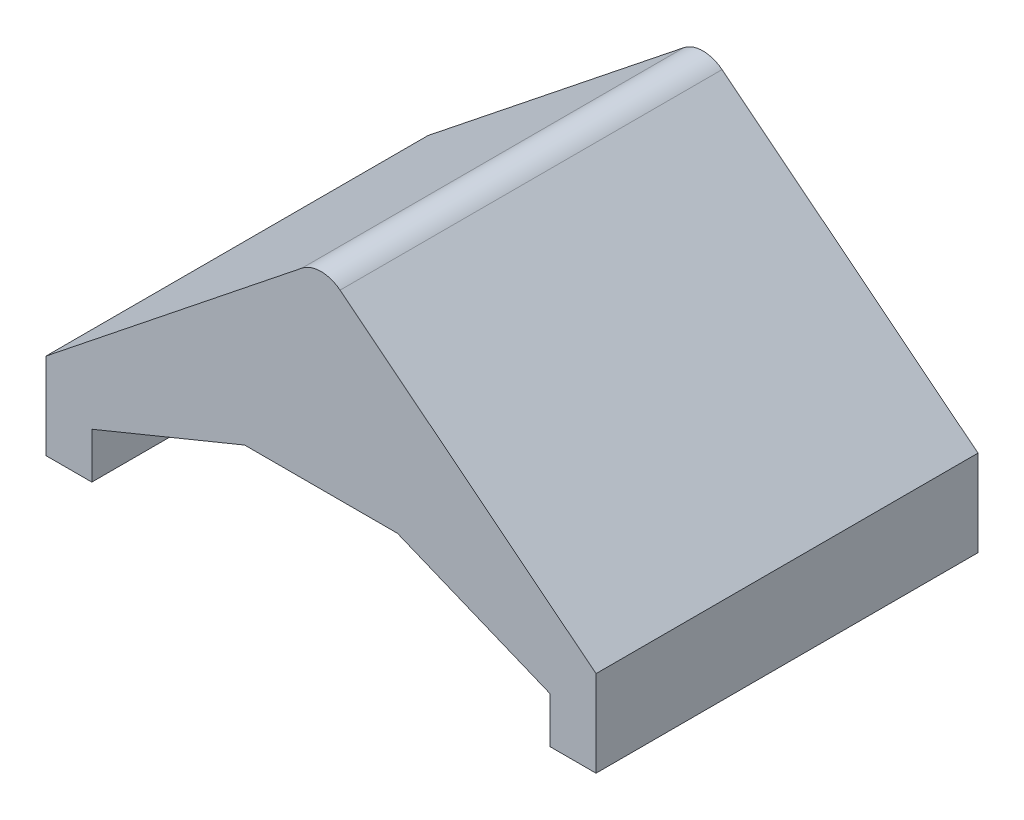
ISO-10303-21;
HEADER;
FILE_DESCRIPTION(('STEP AP214'),'2;1');
FILE_NAME('part.step','',(''),(''),'','','');
FILE_SCHEMA(('AUTOMOTIVE_DESIGN { 1 0 10303 214 1 1 1 1 }'));
ENDSEC;
DATA;
#1=APPLICATION_CONTEXT('core data for automotive mechanical design processes');
#2=APPLICATION_PROTOCOL_DEFINITION('international standard','automotive_design',2000,#1);
#3=PRODUCT_CONTEXT('',#1,'mechanical');
#4=PRODUCT('Part','Part','',(#3));
#5=PRODUCT_RELATED_PRODUCT_CATEGORY('part','',(#4));
#6=PRODUCT_DEFINITION_FORMATION('','',#4);
#7=PRODUCT_DEFINITION_CONTEXT('part definition',#1,'design');
#8=PRODUCT_DEFINITION('design','',#6,#7);
#9=PRODUCT_DEFINITION_SHAPE('','',#8);
#10=(LENGTH_UNIT() NAMED_UNIT(*) SI_UNIT(.MILLI.,.METRE.));
#11=(NAMED_UNIT(*) PLANE_ANGLE_UNIT() SI_UNIT($,.RADIAN.));
#12=(NAMED_UNIT(*) SI_UNIT($,.STERADIAN.) SOLID_ANGLE_UNIT());
#13=UNCERTAINTY_MEASURE_WITH_UNIT(LENGTH_MEASURE(1.E-05),#10,'distance_accuracy_value','');
#14=(GEOMETRIC_REPRESENTATION_CONTEXT(3) GLOBAL_UNCERTAINTY_ASSIGNED_CONTEXT((#13)) GLOBAL_UNIT_ASSIGNED_CONTEXT((#10,
#11,#12)) REPRESENTATION_CONTEXT('',''));
#15=CARTESIAN_POINT('',(0.,0.,0.));
#16=DIRECTION('',(0.,0.,1.));
#17=DIRECTION('',(1.,0.,0.));
#18=AXIS2_PLACEMENT_3D('',#15,#16,#17);
#19=CARTESIAN_POINT('',(0.,5.6457513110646,25.));
#20=DIRECTION('',(1.,0.,0.));
#21=DIRECTION('',(0.,1.,0.));
#22=AXIS2_PLACEMENT_3D('',#19,#20,#21);
#23=PLANE('',#22);
#24=DIRECTION('',(0.,-1.,0.));
#25=VECTOR('',#24,1.);
#26=CARTESIAN_POINT('',(0.,5.6457513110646,0.));
#27=LINE('',#26,#25);
#28=CARTESIAN_POINT('',(0.,5.6457513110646,0.));
#29=VERTEX_POINT('',#28);
#30=CARTESIAN_POINT('',(0.,0.,0.));
#31=VERTEX_POINT('',#30);
#32=EDGE_CURVE('E147',#29,#31,#27,.T.);
#33=ORIENTED_EDGE('',*,*,#32,.T.);
#34=DIRECTION('',(0.,0.,-1.));
#35=VECTOR('',#34,1.);
#36=CARTESIAN_POINT('',(0.,0.,25.));
#37=LINE('',#36,#35);
#38=CARTESIAN_POINT('',(0.,0.,25.));
#39=VERTEX_POINT('',#38);
#40=EDGE_CURVE('E128',#39,#31,#37,.T.);
#41=ORIENTED_EDGE('',*,*,#40,.F.);
#42=DIRECTION('',(0.,-1.,0.));
#43=VECTOR('',#42,1.);
#44=CARTESIAN_POINT('',(0.,5.6457513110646,25.));
#45=LINE('',#44,#43);
#46=CARTESIAN_POINT('',(0.,5.6457513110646,25.));
#47=VERTEX_POINT('',#46);
#48=EDGE_CURVE('E135',#47,#39,#45,.T.);
#49=ORIENTED_EDGE('',*,*,#48,.F.);
#50=DIRECTION('',(0.,0.,-1.));
#51=VECTOR('',#50,1.);
#52=CARTESIAN_POINT('',(0.,5.6457513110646,25.));
#53=LINE('',#52,#51);
#54=EDGE_CURVE('E197',#47,#29,#53,.T.);
#55=ORIENTED_EDGE('',*,*,#54,.T.);
#56=EDGE_LOOP('',(#33,#41,#49,#55));
#57=FACE_BOUND('',#56,.T.);
#58=ADVANCED_FACE('F33',(#57),#23,.F.);
#59=CARTESIAN_POINT('',(0.,0.,25.));
#60=DIRECTION('',(0.,1.,0.));
#61=DIRECTION('',(0.,0.,1.));
#62=AXIS2_PLACEMENT_3D('',#59,#60,#61);
#63=PLANE('',#62);
#64=DIRECTION('',(1.,0.,0.));
#65=VECTOR('',#64,1.);
#66=CARTESIAN_POINT('',(0.,0.,0.));
#67=LINE('',#66,#65);
#68=CARTESIAN_POINT('',(3.,0.,0.));
#69=VERTEX_POINT('',#68);
#70=EDGE_CURVE('E206',#31,#69,#67,.T.);
#71=ORIENTED_EDGE('',*,*,#70,.T.);
#72=DIRECTION('',(0.,0.,-1.));
#73=VECTOR('',#72,1.);
#74=CARTESIAN_POINT('',(3.,0.,25.));
#75=LINE('',#74,#73);
#76=CARTESIAN_POINT('',(3.,0.,25.));
#77=VERTEX_POINT('',#76);
#78=EDGE_CURVE('E131',#77,#69,#75,.T.);
#79=ORIENTED_EDGE('',*,*,#78,.F.);
#80=DIRECTION('',(1.,0.,0.));
#81=VECTOR('',#80,1.);
#82=CARTESIAN_POINT('',(0.,0.,25.));
#83=LINE('',#82,#81);
#84=EDGE_CURVE('E124',#39,#77,#83,.T.);
#85=ORIENTED_EDGE('',*,*,#84,.F.);
#86=ORIENTED_EDGE('',*,*,#40,.T.);
#87=EDGE_LOOP('',(#71,#79,#85,#86));
#88=FACE_BOUND('',#87,.T.);
#89=ADVANCED_FACE('F126',(#88),#63,.F.);
#90=CARTESIAN_POINT('',(3.,0.,25.));
#91=DIRECTION('',(-1.,0.,0.));
#92=DIRECTION('',(0.,0.,1.));
#93=AXIS2_PLACEMENT_3D('',#90,#91,#92);
#94=PLANE('',#93);
#95=DIRECTION('',(0.,1.,0.));
#96=VECTOR('',#95,1.);
#97=CARTESIAN_POINT('',(3.,0.,0.));
#98=LINE('',#97,#96);
#99=CARTESIAN_POINT('',(3.,3.,0.));
#100=VERTEX_POINT('',#99);
#101=EDGE_CURVE('E209',#69,#100,#98,.T.);
#102=ORIENTED_EDGE('',*,*,#101,.T.);
#103=DIRECTION('',(0.,0.,-1.));
#104=VECTOR('',#103,1.);
#105=CARTESIAN_POINT('',(3.,3.,25.));
#106=LINE('',#105,#104);
#107=CARTESIAN_POINT('',(3.,3.,25.));
#108=VERTEX_POINT('',#107);
#109=EDGE_CURVE('E152',#108,#100,#106,.T.);
#110=ORIENTED_EDGE('',*,*,#109,.F.);
#111=DIRECTION('',(0.,1.,0.));
#112=VECTOR('',#111,1.);
#113=CARTESIAN_POINT('',(3.,0.,25.));
#114=LINE('',#113,#112);
#115=EDGE_CURVE('E134',#77,#108,#114,.T.);
#116=ORIENTED_EDGE('',*,*,#115,.F.);
#117=ORIENTED_EDGE('',*,*,#78,.T.);
#118=EDGE_LOOP('',(#102,#110,#116,#117));
#119=FACE_BOUND('',#118,.T.);
#120=ADVANCED_FACE('F179',(#119),#94,.F.);
#121=CARTESIAN_POINT('',(3.,3.,25.));
#122=DIRECTION('',(-0.379353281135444,0.9252519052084,0.));
#123=DIRECTION('',(-0.9252519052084,-0.379353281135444,0.));
#124=AXIS2_PLACEMENT_3D('',#121,#122,#123);
#125=PLANE('',#124);
#126=DIRECTION('',(0.925251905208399,0.379353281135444,0.));
#127=VECTOR('',#126,1.);
#128=CARTESIAN_POINT('',(3.,3.,0.));
#129=LINE('',#128,#127);
#130=CARTESIAN_POINT('',(13.,7.1,0.));
#131=VERTEX_POINT('',#130);
#132=EDGE_CURVE('E211',#100,#131,#129,.T.);
#133=ORIENTED_EDGE('',*,*,#132,.T.);
#134=DIRECTION('',(0.,0.,-1.));
#135=VECTOR('',#134,1.);
#136=CARTESIAN_POINT('',(13.,7.1,25.));
#137=LINE('',#136,#135);
#138=CARTESIAN_POINT('',(13.,7.1,25.));
#139=VERTEX_POINT('',#138);
#140=EDGE_CURVE('E240',#139,#131,#137,.T.);
#141=ORIENTED_EDGE('',*,*,#140,.F.);
#142=DIRECTION('',(0.925251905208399,0.379353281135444,0.));
#143=VECTOR('',#142,1.);
#144=CARTESIAN_POINT('',(3.,3.,25.));
#145=LINE('',#144,#143);
#146=EDGE_CURVE('E249',#108,#139,#145,.T.);
#147=ORIENTED_EDGE('',*,*,#146,.F.);
#148=ORIENTED_EDGE('',*,*,#109,.T.);
#149=EDGE_LOOP('',(#133,#141,#147,#148));
#150=FACE_BOUND('',#149,.T.);
#151=ADVANCED_FACE('F247',(#150),#125,.F.);
#152=CARTESIAN_POINT('',(13.,7.1,25.));
#153=DIRECTION('',(0.,1.,0.));
#154=DIRECTION('',(0.,0.,1.));
#155=AXIS2_PLACEMENT_3D('',#152,#153,#154);
#156=PLANE('',#155);
#157=CARTESIAN_POINT('',(18.,7.1,12.5));
#158=DIRECTION('',(0.,1.,0.));
#159=DIRECTION('',(0.,0.,1.));
#160=AXIS2_PLACEMENT_3D('',#157,#158,#159);
#161=CIRCLE('',#160,3.75);
#162=CARTESIAN_POINT('',(18.,7.1,16.25));
#163=VERTEX_POINT('',#162);
#164=EDGE_CURVE('E11',#163,#163,#161,.T.);
#165=ORIENTED_EDGE('',*,*,#164,.T.);
#166=EDGE_LOOP('',(#165));
#167=FACE_BOUND('',#166,.T.);
#168=DIRECTION('',(1.,0.,0.));
#169=VECTOR('',#168,1.);
#170=CARTESIAN_POINT('',(13.,7.1,0.));
#171=LINE('',#170,#169);
#172=CARTESIAN_POINT('',(23.,7.1,0.));
#173=VERTEX_POINT('',#172);
#174=EDGE_CURVE('E213',#131,#173,#171,.T.);
#175=ORIENTED_EDGE('',*,*,#174,.T.);
#176=DIRECTION('',(0.,0.,-1.));
#177=VECTOR('',#176,1.);
#178=CARTESIAN_POINT('',(23.,7.1,25.));
#179=LINE('',#178,#177);
#180=CARTESIAN_POINT('',(23.,7.1,25.));
#181=VERTEX_POINT('',#180);
#182=EDGE_CURVE('E237',#181,#173,#179,.T.);
#183=ORIENTED_EDGE('',*,*,#182,.F.);
#184=DIRECTION('',(1.,0.,0.));
#185=VECTOR('',#184,1.);
#186=CARTESIAN_POINT('',(13.,7.1,25.));
#187=LINE('',#186,#185);
#188=EDGE_CURVE('E266',#139,#181,#187,.T.);
#189=ORIENTED_EDGE('',*,*,#188,.F.);
#190=ORIENTED_EDGE('',*,*,#140,.T.);
#191=EDGE_LOOP('',(#175,#183,#189,#190));
#192=FACE_BOUND('',#191,.T.);
#193=ADVANCED_FACE('F257',(#167,#192),#156,.F.);
#194=CARTESIAN_POINT('',(23.,7.1,25.));
#195=DIRECTION('',(0.379353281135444,0.9252519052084,0.));
#196=DIRECTION('',(-0.9252519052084,0.379353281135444,0.));
#197=AXIS2_PLACEMENT_3D('',#194,#195,#196);
#198=PLANE('',#197);
#199=DIRECTION('',(0.9252519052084,-0.379353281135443,0.));
#200=VECTOR('',#199,1.);
#201=CARTESIAN_POINT('',(23.,7.1,0.));
#202=LINE('',#201,#200);
#203=CARTESIAN_POINT('',(33.,3.,0.));
#204=VERTEX_POINT('',#203);
#205=EDGE_CURVE('E215',#173,#204,#202,.T.);
#206=ORIENTED_EDGE('',*,*,#205,.T.);
#207=DIRECTION('',(0.,0.,-1.));
#208=VECTOR('',#207,1.);
#209=CARTESIAN_POINT('',(33.,3.,25.));
#210=LINE('',#209,#208);
#211=CARTESIAN_POINT('',(33.,3.,25.));
#212=VERTEX_POINT('',#211);
#213=EDGE_CURVE('E234',#212,#204,#210,.T.);
#214=ORIENTED_EDGE('',*,*,#213,.F.);
#215=DIRECTION('',(0.9252519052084,-0.379353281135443,0.));
#216=VECTOR('',#215,1.);
#217=CARTESIAN_POINT('',(23.,7.1,25.));
#218=LINE('',#217,#216);
#219=EDGE_CURVE('E263',#181,#212,#218,.T.);
#220=ORIENTED_EDGE('',*,*,#219,.F.);
#221=ORIENTED_EDGE('',*,*,#182,.T.);
#222=EDGE_LOOP('',(#206,#214,#220,#221));
#223=FACE_BOUND('',#222,.T.);
#224=ADVANCED_FACE('F261',(#223),#198,.F.);
#225=CARTESIAN_POINT('',(33.,3.,25.));
#226=DIRECTION('',(1.,0.,0.));
#227=DIRECTION('',(0.,1.,0.));
#228=AXIS2_PLACEMENT_3D('',#225,#226,#227);
#229=PLANE('',#228);
#230=DIRECTION('',(0.,-1.,0.));
#231=VECTOR('',#230,1.);
#232=CARTESIAN_POINT('',(33.,3.,0.));
#233=LINE('',#232,#231);
#234=CARTESIAN_POINT('',(33.,0.,0.));
#235=VERTEX_POINT('',#234);
#236=EDGE_CURVE('E217',#204,#235,#233,.T.);
#237=ORIENTED_EDGE('',*,*,#236,.T.);
#238=DIRECTION('',(0.,0.,-1.));
#239=VECTOR('',#238,1.);
#240=CARTESIAN_POINT('',(33.,0.,25.));
#241=LINE('',#240,#239);
#242=CARTESIAN_POINT('',(33.,0.,25.));
#243=VERTEX_POINT('',#242);
#244=EDGE_CURVE('E231',#243,#235,#241,.T.);
#245=ORIENTED_EDGE('',*,*,#244,.F.);
#246=DIRECTION('',(0.,-1.,0.));
#247=VECTOR('',#246,1.);
#248=CARTESIAN_POINT('',(33.,3.,25.));
#249=LINE('',#248,#247);
#250=EDGE_CURVE('E265',#212,#243,#249,.T.);
#251=ORIENTED_EDGE('',*,*,#250,.F.);
#252=ORIENTED_EDGE('',*,*,#213,.T.);
#253=EDGE_LOOP('',(#237,#245,#251,#252));
#254=FACE_BOUND('',#253,.T.);
#255=ADVANCED_FACE('F293',(#254),#229,.F.);
#256=CARTESIAN_POINT('',(33.,0.,25.));
#257=DIRECTION('',(0.,1.,0.));
#258=DIRECTION('',(-1.,0.,0.));
#259=AXIS2_PLACEMENT_3D('',#256,#257,#258);
#260=PLANE('',#259);
#261=DIRECTION('',(1.,0.,0.));
#262=VECTOR('',#261,1.);
#263=CARTESIAN_POINT('',(33.,0.,0.));
#264=LINE('',#263,#262);
#265=CARTESIAN_POINT('',(36.,0.,0.));
#266=VERTEX_POINT('',#265);
#267=EDGE_CURVE('E219',#235,#266,#264,.T.);
#268=ORIENTED_EDGE('',*,*,#267,.T.);
#269=DIRECTION('',(0.,0.,-1.));
#270=VECTOR('',#269,1.);
#271=CARTESIAN_POINT('',(36.,0.,25.));
#272=LINE('',#271,#270);
#273=CARTESIAN_POINT('',(36.,0.,25.));
#274=VERTEX_POINT('',#273);
#275=EDGE_CURVE('E228',#274,#266,#272,.T.);
#276=ORIENTED_EDGE('',*,*,#275,.F.);
#277=DIRECTION('',(1.,0.,0.));
#278=VECTOR('',#277,1.);
#279=CARTESIAN_POINT('',(33.,0.,25.));
#280=LINE('',#279,#278);
#281=EDGE_CURVE('E268',#243,#274,#280,.T.);
#282=ORIENTED_EDGE('',*,*,#281,.F.);
#283=ORIENTED_EDGE('',*,*,#244,.T.);
#284=EDGE_LOOP('',(#268,#276,#282,#283));
#285=FACE_BOUND('',#284,.T.);
#286=ADVANCED_FACE('F288',(#285),#260,.F.);
#287=CARTESIAN_POINT('',(36.,0.,25.));
#288=DIRECTION('',(-1.,0.,0.));
#289=DIRECTION('',(0.,0.,1.));
#290=AXIS2_PLACEMENT_3D('',#287,#288,#289);
#291=PLANE('',#290);
#292=DIRECTION('',(0.,1.,0.));
#293=VECTOR('',#292,1.);
#294=CARTESIAN_POINT('',(36.,0.,0.));
#295=LINE('',#294,#293);
#296=CARTESIAN_POINT('',(36.,5.6457513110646,0.));
#297=VERTEX_POINT('',#296);
#298=EDGE_CURVE('E221',#266,#297,#295,.T.);
#299=ORIENTED_EDGE('',*,*,#298,.T.);
#300=DIRECTION('',(0.,0.,-1.));
#301=VECTOR('',#300,1.);
#302=CARTESIAN_POINT('',(36.,5.6457513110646,25.));
#303=LINE('',#302,#301);
#304=CARTESIAN_POINT('',(36.,5.6457513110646,25.));
#305=VERTEX_POINT('',#304);
#306=EDGE_CURVE('E199',#305,#297,#303,.T.);
#307=ORIENTED_EDGE('',*,*,#306,.F.);
#308=DIRECTION('',(0.,1.,0.));
#309=VECTOR('',#308,1.);
#310=CARTESIAN_POINT('',(36.,0.,25.));
#311=LINE('',#310,#309);
#312=EDGE_CURVE('E201',#274,#305,#311,.T.);
#313=ORIENTED_EDGE('',*,*,#312,.F.);
#314=ORIENTED_EDGE('',*,*,#275,.T.);
#315=EDGE_LOOP('',(#299,#307,#313,#314));
#316=FACE_BOUND('',#315,.T.);
#317=ADVANCED_FACE('F278',(#316),#291,.F.);
#318=CARTESIAN_POINT('',(36.,5.6457513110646,25.));
#319=DIRECTION('',(-0.623482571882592,-0.781837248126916,0.));
#320=DIRECTION('',(0.781837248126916,-0.623482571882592,0.));
#321=AXIS2_PLACEMENT_3D('',#318,#319,#320);
#322=PLANE('',#321);
#323=DIRECTION('',(-0.781837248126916,0.623482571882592,0.));
#324=VECTOR('',#323,1.);
#325=CARTESIAN_POINT('',(36.,5.6457513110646,0.));
#326=LINE('',#325,#324);
#327=CARTESIAN_POINT('',(19.2469651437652,19.0055973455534,0.));
#328=VERTEX_POINT('',#327);
#329=EDGE_CURVE('E223',#297,#328,#326,.T.);
#330=ORIENTED_EDGE('',*,*,#329,.T.);
#331=DIRECTION('',(0.,0.,-1.));
#332=VECTOR('',#331,1.);
#333=CARTESIAN_POINT('',(19.2469651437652,19.0055973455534,25.));
#334=LINE('',#333,#332);
#335=CARTESIAN_POINT('',(19.2469651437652,19.0055973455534,25.));
#336=VERTEX_POINT('',#335);
#337=EDGE_CURVE('E48',#328,#336,#334,.F.);
#338=ORIENTED_EDGE('',*,*,#337,.T.);
#339=DIRECTION('',(-0.781837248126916,0.623482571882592,0.));
#340=VECTOR('',#339,1.);
#341=CARTESIAN_POINT('',(36.,5.6457513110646,25.));
#342=LINE('',#341,#340);
#343=EDGE_CURVE('E194',#305,#336,#342,.T.);
#344=ORIENTED_EDGE('',*,*,#343,.F.);
#345=ORIENTED_EDGE('',*,*,#306,.T.);
#346=EDGE_LOOP('',(#330,#338,#344,#345));
#347=FACE_BOUND('',#346,.T.);
#348=ADVANCED_FACE('F280',(#347),#322,.F.);
#349=CARTESIAN_POINT('',(18.,20.,25.));
#350=DIRECTION('',(0.623482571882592,-0.781837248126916,0.));
#351=DIRECTION('',(0.781837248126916,0.623482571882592,0.));
#352=AXIS2_PLACEMENT_3D('',#349,#350,#351);
#353=PLANE('',#352);
#354=DIRECTION('',(-0.781837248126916,-0.623482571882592,0.));
#355=VECTOR('',#354,1.);
#356=CARTESIAN_POINT('',(18.,20.,25.));
#357=LINE('',#356,#355);
#358=CARTESIAN_POINT('',(16.7530348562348,19.0055973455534,25.));
#359=VERTEX_POINT('',#358);
#360=EDGE_CURVE('E140',#359,#47,#357,.T.);
#361=ORIENTED_EDGE('',*,*,#360,.F.);
#362=DIRECTION('',(0.,0.,-1.));
#363=VECTOR('',#362,1.);
#364=CARTESIAN_POINT('',(16.7530348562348,19.0055973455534,25.));
#365=LINE('',#364,#363);
#366=CARTESIAN_POINT('',(16.7530348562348,19.0055973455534,0.));
#367=VERTEX_POINT('',#366);
#368=EDGE_CURVE('E148',#359,#367,#365,.T.);
#369=ORIENTED_EDGE('',*,*,#368,.T.);
#370=DIRECTION('',(-0.781837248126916,-0.623482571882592,0.));
#371=VECTOR('',#370,1.);
#372=CARTESIAN_POINT('',(18.,20.,0.));
#373=LINE('',#372,#371);
#374=EDGE_CURVE('E144',#367,#29,#373,.T.);
#375=ORIENTED_EDGE('',*,*,#374,.T.);
#376=ORIENTED_EDGE('',*,*,#54,.F.);
#377=EDGE_LOOP('',(#361,#369,#375,#376));
#378=FACE_BOUND('',#377,.T.);
#379=ADVANCED_FACE('F196',(#378),#353,.F.);
#380=CARTESIAN_POINT('',(0.,0.,25.));
#381=DIRECTION('',(0.,0.,1.));
#382=DIRECTION('',(1.,0.,0.));
#383=AXIS2_PLACEMENT_3D('',#380,#381,#382);
#384=PLANE('',#383);
#385=ORIENTED_EDGE('',*,*,#343,.T.);
#386=CARTESIAN_POINT('',(18.,17.4419228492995,25.));
#387=DIRECTION('',(0.,0.,1.));
#388=DIRECTION('',(1.,0.,0.));
#389=AXIS2_PLACEMENT_3D('',#386,#387,#388);
#390=CIRCLE('',#389,2.);
#391=EDGE_CURVE('E158',#336,#359,#390,.T.);
#392=ORIENTED_EDGE('',*,*,#391,.T.);
#393=ORIENTED_EDGE('',*,*,#360,.T.);
#394=ORIENTED_EDGE('',*,*,#48,.T.);
#395=ORIENTED_EDGE('',*,*,#84,.T.);
#396=ORIENTED_EDGE('',*,*,#115,.T.);
#397=ORIENTED_EDGE('',*,*,#146,.T.);
#398=ORIENTED_EDGE('',*,*,#188,.T.);
#399=ORIENTED_EDGE('',*,*,#219,.T.);
#400=ORIENTED_EDGE('',*,*,#250,.T.);
#401=ORIENTED_EDGE('',*,*,#281,.T.);
#402=ORIENTED_EDGE('',*,*,#312,.T.);
#403=EDGE_LOOP('',(#385,#392,#393,#394,#395,#396,#397,#398,#399,#400,#401,#402));
#404=FACE_BOUND('',#403,.T.);
#405=ADVANCED_FACE('F138',(#404),#384,.T.);
#406=CARTESIAN_POINT('',(0.,0.,0.));
#407=DIRECTION('',(0.,0.,1.));
#408=DIRECTION('',(1.,0.,0.));
#409=AXIS2_PLACEMENT_3D('',#406,#407,#408);
#410=PLANE('',#409);
#411=ORIENTED_EDGE('',*,*,#374,.F.);
#412=CARTESIAN_POINT('',(18.,17.4419228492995,0.));
#413=DIRECTION('',(0.,0.,1.));
#414=DIRECTION('',(1.,0.,0.));
#415=AXIS2_PLACEMENT_3D('',#412,#413,#414);
#416=CIRCLE('',#415,2.);
#417=EDGE_CURVE('E56',#367,#328,#416,.F.);
#418=ORIENTED_EDGE('',*,*,#417,.T.);
#419=ORIENTED_EDGE('',*,*,#329,.F.);
#420=ORIENTED_EDGE('',*,*,#298,.F.);
#421=ORIENTED_EDGE('',*,*,#267,.F.);
#422=ORIENTED_EDGE('',*,*,#236,.F.);
#423=ORIENTED_EDGE('',*,*,#205,.F.);
#424=ORIENTED_EDGE('',*,*,#174,.F.);
#425=ORIENTED_EDGE('',*,*,#132,.F.);
#426=ORIENTED_EDGE('',*,*,#101,.F.);
#427=ORIENTED_EDGE('',*,*,#70,.F.);
#428=ORIENTED_EDGE('',*,*,#32,.F.);
#429=EDGE_LOOP('',(#411,#418,#419,#420,#421,#422,#423,#424,#425,#426,#427,#428));
#430=FACE_BOUND('',#429,.T.);
#431=ADVANCED_FACE('F184',(#430),#410,.F.);
#432=CARTESIAN_POINT('',(18.,17.4419228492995,25.));
#433=DIRECTION('',(0.,0.,-1.));
#434=DIRECTION('',(-1.,0.,0.));
#435=AXIS2_PLACEMENT_3D('',#432,#433,#434);
#436=CYLINDRICAL_SURFACE('',#435,2.);
#437=ORIENTED_EDGE('',*,*,#391,.F.);
#438=ORIENTED_EDGE('',*,*,#337,.F.);
#439=ORIENTED_EDGE('',*,*,#417,.F.);
#440=ORIENTED_EDGE('',*,*,#368,.F.);
#441=EDGE_LOOP('',(#437,#438,#439,#440));
#442=FACE_BOUND('',#441,.T.);
#443=ADVANCED_FACE('F182',(#442),#436,.T.);
#444=CARTESIAN_POINT('',(18.,15.1,12.5));
#445=DIRECTION('',(0.,-1.,0.));
#446=DIRECTION('',(0.,0.,-1.));
#447=AXIS2_PLACEMENT_3D('',#444,#445,#446);
#448=CYLINDRICAL_SURFACE('',#447,3.25);
#449=CARTESIAN_POINT('',(18.,7.6,12.5));
#450=DIRECTION('',(0.,1.,0.));
#451=DIRECTION('',(0.,0.,1.));
#452=AXIS2_PLACEMENT_3D('',#449,#450,#451);
#453=CIRCLE('',#452,3.25);
#454=CARTESIAN_POINT('',(18.,7.6,15.75));
#455=VERTEX_POINT('',#454);
#456=EDGE_CURVE('E41',#455,#455,#453,.F.);
#457=ORIENTED_EDGE('',*,*,#456,.T.);
#458=EDGE_LOOP('',(#457));
#459=FACE_BOUND('',#458,.T.);
#460=CARTESIAN_POINT('',(18.,15.1,12.5));
#461=DIRECTION('',(0.,-1.,0.));
#462=DIRECTION('',(0.,0.,-1.));
#463=AXIS2_PLACEMENT_3D('',#460,#461,#462);
#464=CIRCLE('',#463,3.25);
#465=CARTESIAN_POINT('',(18.,15.1,9.25));
#466=VERTEX_POINT('',#465);
#467=EDGE_CURVE('E207',#466,#466,#464,.T.);
#468=ORIENTED_EDGE('',*,*,#467,.F.);
#469=EDGE_LOOP('',(#468));
#470=FACE_BOUND('',#469,.T.);
#471=ADVANCED_FACE('F162',(#459,#470),#448,.F.);
#472=CARTESIAN_POINT('',(18.,15.1,12.5));
#473=DIRECTION('',(0.,-1.,0.));
#474=DIRECTION('',(0.,0.,-1.));
#475=AXIS2_PLACEMENT_3D('',#472,#473,#474);
#476=PLANE('',#475);
#477=ORIENTED_EDGE('',*,*,#467,.T.);
#478=EDGE_LOOP('',(#477));
#479=FACE_BOUND('',#478,.T.);
#480=ADVANCED_FACE('F166',(#479),#476,.T.);
#481=CARTESIAN_POINT('',(18.,7.6,12.5));
#482=DIRECTION('',(0.,-1.,0.));
#483=DIRECTION('',(0.,0.,-1.));
#484=AXIS2_PLACEMENT_3D('',#481,#482,#483);
#485=CONICAL_SURFACE('',#484,3.25,0.785398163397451);
#486=ORIENTED_EDGE('',*,*,#164,.F.);
#487=EDGE_LOOP('',(#486));
#488=FACE_BOUND('',#487,.T.);
#489=ORIENTED_EDGE('',*,*,#456,.F.);
#490=EDGE_LOOP('',(#489));
#491=FACE_BOUND('',#490,.T.);
#492=ADVANCED_FACE('F35',(#488,#491),#485,.F.);
#493=CLOSED_SHELL('',(#58,#89,#120,#151,#193,#224,#255,#286,#317,#348,#379,#405,#431,#443,#471,
#480,#492));
#494=MANIFOLD_SOLID_BREP('B2',#493);
#495=ADVANCED_BREP_SHAPE_REPRESENTATION('',(#18,#494),#14);
#496=SHAPE_DEFINITION_REPRESENTATION(#9,#495);
ENDSEC;
END-ISO-10303-21;
